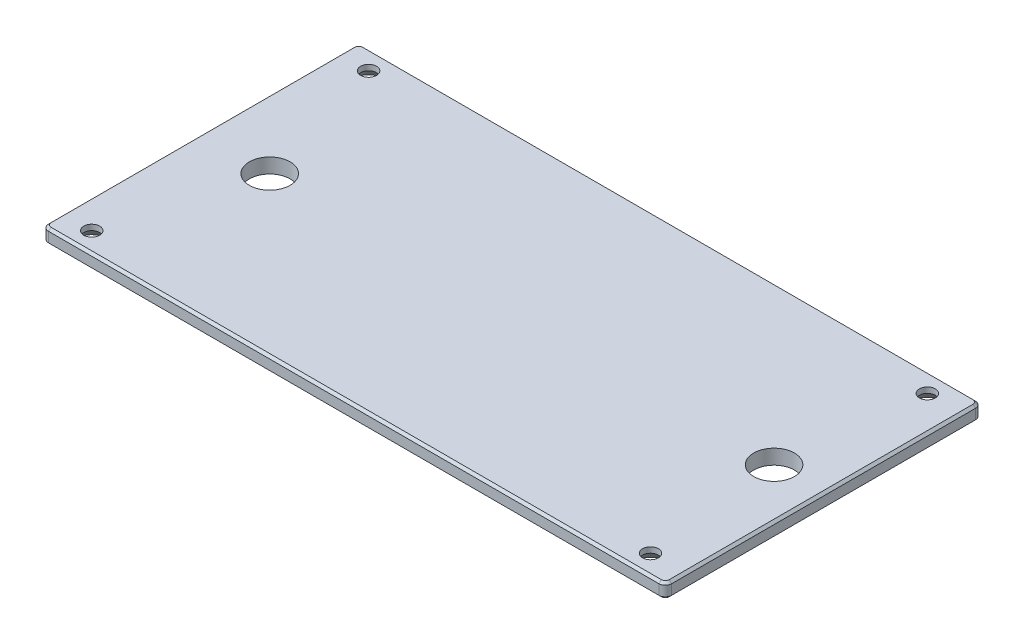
ISO-10303-21;
HEADER;
FILE_DESCRIPTION(('STEP AP214'),'2;1');
FILE_NAME('part.step','',(''),(''),'','','');
FILE_SCHEMA(('AUTOMOTIVE_DESIGN { 1 0 10303 214 1 1 1 1 }'));
ENDSEC;
DATA;
#1=APPLICATION_CONTEXT('core data for automotive mechanical design processes');
#2=APPLICATION_PROTOCOL_DEFINITION('international standard','automotive_design',2000,#1);
#3=PRODUCT_CONTEXT('',#1,'mechanical');
#4=PRODUCT('Part','Part','',(#3));
#5=PRODUCT_RELATED_PRODUCT_CATEGORY('part','',(#4));
#6=PRODUCT_DEFINITION_FORMATION('','',#4);
#7=PRODUCT_DEFINITION_CONTEXT('part definition',#1,'design');
#8=PRODUCT_DEFINITION('design','',#6,#7);
#9=PRODUCT_DEFINITION_SHAPE('','',#8);
#10=(LENGTH_UNIT() NAMED_UNIT(*) SI_UNIT(.MILLI.,.METRE.));
#11=(NAMED_UNIT(*) PLANE_ANGLE_UNIT() SI_UNIT($,.RADIAN.));
#12=(NAMED_UNIT(*) SI_UNIT($,.STERADIAN.) SOLID_ANGLE_UNIT());
#13=UNCERTAINTY_MEASURE_WITH_UNIT(LENGTH_MEASURE(1.E-05),#10,'distance_accuracy_value','');
#14=(GEOMETRIC_REPRESENTATION_CONTEXT(3) GLOBAL_UNCERTAINTY_ASSIGNED_CONTEXT((#13)) GLOBAL_UNIT_ASSIGNED_CONTEXT((#10,
#11,#12)) REPRESENTATION_CONTEXT('',''));
#15=CARTESIAN_POINT('',(0.,0.,0.));
#16=DIRECTION('',(0.,0.,1.));
#17=DIRECTION('',(1.,0.,0.));
#18=AXIS2_PLACEMENT_3D('',#15,#16,#17);
#19=CARTESIAN_POINT('',(-98.425,4.7498,-50.8));
#20=DIRECTION('',(1.,0.,0.));
#21=DIRECTION('',(0.,0.,-1.));
#22=AXIS2_PLACEMENT_3D('',#19,#20,#21);
#23=PLANE('',#22);
#24=DIRECTION('',(0.,-1.,0.));
#25=VECTOR('',#24,1.);
#26=CARTESIAN_POINT('',(-98.425,4.7498,48.768));
#27=LINE('',#26,#25);
#28=CARTESIAN_POINT('',(-98.425,0.761999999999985,48.768));
#29=VERTEX_POINT('',#28);
#30=CARTESIAN_POINT('',(-98.425,3.98780000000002,48.768));
#31=VERTEX_POINT('',#30);
#32=EDGE_CURVE('E302',#29,#31,#27,.F.);
#33=ORIENTED_EDGE('',*,*,#32,.T.);
#34=DIRECTION('',(0.,0.,-1.));
#35=VECTOR('',#34,1.);
#36=CARTESIAN_POINT('',(-98.425,3.9878000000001,-48.768));
#37=LINE('',#36,#35);
#38=CARTESIAN_POINT('',(-98.425,3.98780000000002,-48.768));
#39=VERTEX_POINT('',#38);
#40=EDGE_CURVE('E205',#31,#39,#37,.T.);
#41=ORIENTED_EDGE('',*,*,#40,.T.);
#42=DIRECTION('',(0.,-1.,0.));
#43=VECTOR('',#42,1.);
#44=CARTESIAN_POINT('',(-98.425,4.7498,-48.768));
#45=LINE('',#44,#43);
#46=CARTESIAN_POINT('',(-98.425,0.761999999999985,-48.768));
#47=VERTEX_POINT('',#46);
#48=EDGE_CURVE('E319',#39,#47,#45,.T.);
#49=ORIENTED_EDGE('',*,*,#48,.T.);
#50=DIRECTION('',(0.,0.,1.));
#51=VECTOR('',#50,1.);
#52=CARTESIAN_POINT('',(-98.425,0.761999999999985,-50.8));
#53=LINE('',#52,#51);
#54=EDGE_CURVE('E203',#47,#29,#53,.T.);
#55=ORIENTED_EDGE('',*,*,#54,.T.);
#56=EDGE_LOOP('',(#33,#41,#49,#55));
#57=FACE_BOUND('',#56,.T.);
#58=ADVANCED_FACE('F34',(#57),#23,.F.);
#59=CARTESIAN_POINT('',(-98.425,4.7498,50.8));
#60=DIRECTION('',(0.,0.,-1.));
#61=DIRECTION('',(-1.,0.,0.));
#62=AXIS2_PLACEMENT_3D('',#59,#60,#61);
#63=PLANE('',#62);
#64=DIRECTION('',(0.,-1.,0.));
#65=VECTOR('',#64,1.);
#66=CARTESIAN_POINT('',(99.568,4.7498,50.8));
#67=LINE('',#66,#65);
#68=CARTESIAN_POINT('',(99.568,0.761999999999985,50.8));
#69=VERTEX_POINT('',#68);
#70=CARTESIAN_POINT('',(99.568,3.98780000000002,50.8));
#71=VERTEX_POINT('',#70);
#72=EDGE_CURVE('E176',#69,#71,#67,.F.);
#73=ORIENTED_EDGE('',*,*,#72,.T.);
#74=DIRECTION('',(-1.,0.,0.));
#75=VECTOR('',#74,1.);
#76=CARTESIAN_POINT('',(-96.393,3.98780000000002,50.8));
#77=LINE('',#76,#75);
#78=CARTESIAN_POINT('',(-96.393,3.98780000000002,50.8));
#79=VERTEX_POINT('',#78);
#80=EDGE_CURVE('E225',#71,#79,#77,.T.);
#81=ORIENTED_EDGE('',*,*,#80,.T.);
#82=DIRECTION('',(0.,-1.,0.));
#83=VECTOR('',#82,1.);
#84=CARTESIAN_POINT('',(-96.393,4.7498,50.8));
#85=LINE('',#84,#83);
#86=CARTESIAN_POINT('',(-96.393,0.761999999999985,50.8));
#87=VERTEX_POINT('',#86);
#88=EDGE_CURVE('E180',#79,#87,#85,.T.);
#89=ORIENTED_EDGE('',*,*,#88,.T.);
#90=DIRECTION('',(1.,0.,0.));
#91=VECTOR('',#90,1.);
#92=CARTESIAN_POINT('',(-98.425,0.761999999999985,50.8));
#93=LINE('',#92,#91);
#94=EDGE_CURVE('E222',#87,#69,#93,.T.);
#95=ORIENTED_EDGE('',*,*,#94,.T.);
#96=EDGE_LOOP('',(#73,#81,#89,#95));
#97=FACE_BOUND('',#96,.T.);
#98=ADVANCED_FACE('F304',(#97),#63,.F.);
#99=CARTESIAN_POINT('',(101.6,4.7498,-50.8));
#100=DIRECTION('',(-1.,0.,0.));
#101=DIRECTION('',(0.,0.,1.));
#102=AXIS2_PLACEMENT_3D('',#99,#100,#101);
#103=PLANE('',#102);
#104=DIRECTION('',(0.,-1.,0.));
#105=VECTOR('',#104,1.);
#106=CARTESIAN_POINT('',(101.6,4.7498,-48.768));
#107=LINE('',#106,#105);
#108=CARTESIAN_POINT('',(101.6,0.761999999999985,-48.768));
#109=VERTEX_POINT('',#108);
#110=CARTESIAN_POINT('',(101.6,3.98780000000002,-48.768));
#111=VERTEX_POINT('',#110);
#112=EDGE_CURVE('E306',#109,#111,#107,.F.);
#113=ORIENTED_EDGE('',*,*,#112,.T.);
#114=DIRECTION('',(0.,0.,1.));
#115=VECTOR('',#114,1.);
#116=CARTESIAN_POINT('',(101.6,3.98780000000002,48.768));
#117=LINE('',#116,#115);
#118=CARTESIAN_POINT('',(101.6,3.98780000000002,48.768));
#119=VERTEX_POINT('',#118);
#120=EDGE_CURVE('E196',#111,#119,#117,.T.);
#121=ORIENTED_EDGE('',*,*,#120,.T.);
#122=DIRECTION('',(0.,-1.,0.));
#123=VECTOR('',#122,1.);
#124=CARTESIAN_POINT('',(101.6,4.7498,48.768));
#125=LINE('',#124,#123);
#126=CARTESIAN_POINT('',(101.6,0.761999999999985,48.768));
#127=VERTEX_POINT('',#126);
#128=EDGE_CURVE('E308',#119,#127,#125,.T.);
#129=ORIENTED_EDGE('',*,*,#128,.T.);
#130=DIRECTION('',(0.,0.,-1.));
#131=VECTOR('',#130,1.);
#132=CARTESIAN_POINT('',(101.6,0.761999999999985,-50.8));
#133=LINE('',#132,#131);
#134=EDGE_CURVE('E194',#127,#109,#133,.T.);
#135=ORIENTED_EDGE('',*,*,#134,.T.);
#136=EDGE_LOOP('',(#113,#121,#129,#135));
#137=FACE_BOUND('',#136,.T.);
#138=ADVANCED_FACE('F407',(#137),#103,.F.);
#139=CARTESIAN_POINT('',(-98.425,4.7498,-50.8));
#140=DIRECTION('',(0.,0.,1.));
#141=DIRECTION('',(1.,0.,0.));
#142=AXIS2_PLACEMENT_3D('',#139,#140,#141);
#143=PLANE('',#142);
#144=DIRECTION('',(0.,-1.,0.));
#145=VECTOR('',#144,1.);
#146=CARTESIAN_POINT('',(-96.393,4.7498,-50.8));
#147=LINE('',#146,#145);
#148=CARTESIAN_POINT('',(-96.393,0.761999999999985,-50.8));
#149=VERTEX_POINT('',#148);
#150=CARTESIAN_POINT('',(-96.393,3.98780000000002,-50.8));
#151=VERTEX_POINT('',#150);
#152=EDGE_CURVE('E313',#149,#151,#147,.F.);
#153=ORIENTED_EDGE('',*,*,#152,.T.);
#154=DIRECTION('',(1.,0.,0.));
#155=VECTOR('',#154,1.);
#156=CARTESIAN_POINT('',(99.5679999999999,3.98780000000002,-50.8));
#157=LINE('',#156,#155);
#158=CARTESIAN_POINT('',(99.568,3.98780000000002,-50.8));
#159=VERTEX_POINT('',#158);
#160=EDGE_CURVE('E201',#151,#159,#157,.T.);
#161=ORIENTED_EDGE('',*,*,#160,.T.);
#162=DIRECTION('',(0.,-1.,0.));
#163=VECTOR('',#162,1.);
#164=CARTESIAN_POINT('',(99.568,4.7498,-50.8));
#165=LINE('',#164,#163);
#166=CARTESIAN_POINT('',(99.568,0.761999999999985,-50.8));
#167=VERTEX_POINT('',#166);
#168=EDGE_CURVE('E316',#159,#167,#165,.T.);
#169=ORIENTED_EDGE('',*,*,#168,.T.);
#170=DIRECTION('',(-1.,0.,0.));
#171=VECTOR('',#170,1.);
#172=CARTESIAN_POINT('',(-98.425,0.761999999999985,-50.8));
#173=LINE('',#172,#171);
#174=EDGE_CURVE('E199',#167,#149,#173,.T.);
#175=ORIENTED_EDGE('',*,*,#174,.T.);
#176=EDGE_LOOP('',(#153,#161,#169,#175));
#177=FACE_BOUND('',#176,.T.);
#178=ADVANCED_FACE('F604',(#177),#143,.F.);
#179=CARTESIAN_POINT('',(0.,4.7498,0.));
#180=DIRECTION('',(0.,1.,0.));
#181=DIRECTION('',(0.,0.,1.));
#182=AXIS2_PLACEMENT_3D('',#179,#180,#181);
#183=PLANE('',#182);
#184=CARTESIAN_POINT('',(99.568,4.7498,-48.768));
#185=DIRECTION('',(0.,1.,0.));
#186=DIRECTION('',(0.,0.,1.));
#187=AXIS2_PLACEMENT_3D('',#184,#185,#186);
#188=CIRCLE('',#187,1.27000000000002);
#189=CARTESIAN_POINT('',(100.838,4.7498,-48.768));
#190=VERTEX_POINT('',#189);
#191=CARTESIAN_POINT('',(99.568,4.7498,-50.038));
#192=VERTEX_POINT('',#191);
#193=EDGE_CURVE('E188',#190,#192,#188,.T.);
#194=ORIENTED_EDGE('',*,*,#193,.T.);
#195=DIRECTION('',(-1.,0.,0.));
#196=VECTOR('',#195,1.);
#197=CARTESIAN_POINT('',(-96.393,4.7498,-50.038));
#198=LINE('',#197,#196);
#199=CARTESIAN_POINT('',(-96.393,4.7498,-50.038));
#200=VERTEX_POINT('',#199);
#201=EDGE_CURVE('E192',#192,#200,#198,.T.);
#202=ORIENTED_EDGE('',*,*,#201,.T.);
#203=CARTESIAN_POINT('',(-96.393,4.7498,-48.768));
#204=DIRECTION('',(0.,1.,0.));
#205=DIRECTION('',(0.,0.,1.));
#206=AXIS2_PLACEMENT_3D('',#203,#204,#205);
#207=CIRCLE('',#206,1.27000000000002);
#208=CARTESIAN_POINT('',(-97.6630000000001,4.7498,-48.768));
#209=VERTEX_POINT('',#208);
#210=EDGE_CURVE('E190',#200,#209,#207,.T.);
#211=ORIENTED_EDGE('',*,*,#210,.T.);
#212=DIRECTION('',(0.,0.,1.));
#213=VECTOR('',#212,1.);
#214=CARTESIAN_POINT('',(-97.6630000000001,4.7498,48.768));
#215=LINE('',#214,#213);
#216=CARTESIAN_POINT('',(-97.663,4.7498,48.768));
#217=VERTEX_POINT('',#216);
#218=EDGE_CURVE('E156',#209,#217,#215,.T.);
#219=ORIENTED_EDGE('',*,*,#218,.T.);
#220=CARTESIAN_POINT('',(-96.393,4.7498,48.768));
#221=DIRECTION('',(0.,1.,0.));
#222=DIRECTION('',(0.,0.,1.));
#223=AXIS2_PLACEMENT_3D('',#220,#221,#222);
#224=CIRCLE('',#223,1.27000000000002);
#225=CARTESIAN_POINT('',(-96.393,4.7498,50.038));
#226=VERTEX_POINT('',#225);
#227=EDGE_CURVE('E148',#217,#226,#224,.T.);
#228=ORIENTED_EDGE('',*,*,#227,.T.);
#229=DIRECTION('',(1.,0.,0.));
#230=VECTOR('',#229,1.);
#231=CARTESIAN_POINT('',(99.568,4.7498,50.038));
#232=LINE('',#231,#230);
#233=CARTESIAN_POINT('',(99.568,4.7498,50.038));
#234=VERTEX_POINT('',#233);
#235=EDGE_CURVE('E153',#226,#234,#232,.T.);
#236=ORIENTED_EDGE('',*,*,#235,.T.);
#237=CARTESIAN_POINT('',(99.568,4.7498,48.768));
#238=DIRECTION('',(0.,1.,0.));
#239=DIRECTION('',(0.,0.,1.));
#240=AXIS2_PLACEMENT_3D('',#237,#238,#239);
#241=CIRCLE('',#240,1.27000000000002);
#242=CARTESIAN_POINT('',(100.838,4.7498,48.768));
#243=VERTEX_POINT('',#242);
#244=EDGE_CURVE('E160',#234,#243,#241,.T.);
#245=ORIENTED_EDGE('',*,*,#244,.T.);
#246=DIRECTION('',(0.,0.,-1.));
#247=VECTOR('',#246,1.);
#248=CARTESIAN_POINT('',(100.838,4.7498,-48.768));
#249=LINE('',#248,#247);
#250=EDGE_CURVE('E185',#243,#190,#249,.T.);
#251=ORIENTED_EDGE('',*,*,#250,.T.);
#252=EDGE_LOOP('',(#194,#202,#211,#219,#228,#236,#245,#251));
#253=FACE_BOUND('',#252,.T.);
#254=CARTESIAN_POINT('',(-76.2,4.7498,0.));
#255=DIRECTION('',(0.,-1.,0.));
#256=DIRECTION('',(0.,0.,-1.));
#257=AXIS2_PLACEMENT_3D('',#254,#255,#256);
#258=CIRCLE('',#257,6.54050000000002);
#259=CARTESIAN_POINT('',(-76.2,4.7498,-6.54050000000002));
#260=VERTEX_POINT('',#259);
#261=EDGE_CURVE('E365',#260,#260,#258,.T.);
#262=ORIENTED_EDGE('',*,*,#261,.T.);
#263=EDGE_LOOP('',(#262));
#264=FACE_BOUND('',#263,.T.);
#265=CARTESIAN_POINT('',(85.725,4.7498,0.));
#266=DIRECTION('',(0.,-1.,0.));
#267=DIRECTION('',(0.,0.,-1.));
#268=AXIS2_PLACEMENT_3D('',#265,#266,#267);
#269=CIRCLE('',#268,6.54050000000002);
#270=CARTESIAN_POINT('',(85.725,4.7498,-6.54050000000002));
#271=VERTEX_POINT('',#270);
#272=EDGE_CURVE('E359',#271,#271,#269,.T.);
#273=ORIENTED_EDGE('',*,*,#272,.T.);
#274=EDGE_LOOP('',(#273));
#275=FACE_BOUND('',#274,.T.);
#276=CARTESIAN_POINT('',(-88.9,4.7498,44.45));
#277=DIRECTION('',(0.,1.,0.));
#278=DIRECTION('',(0.,0.,1.));
#279=AXIS2_PLACEMENT_3D('',#276,#277,#278);
#280=CIRCLE('',#279,2.5527);
#281=CARTESIAN_POINT('',(-88.9,4.7498,47.0027));
#282=VERTEX_POINT('',#281);
#283=EDGE_CURVE('E324',#282,#282,#280,.T.);
#284=ORIENTED_EDGE('',*,*,#283,.F.);
#285=EDGE_LOOP('',(#284));
#286=FACE_BOUND('',#285,.T.);
#287=CARTESIAN_POINT('',(90.5002,4.7498,44.45));
#288=DIRECTION('',(0.,1.,0.));
#289=DIRECTION('',(0.,0.,1.));
#290=AXIS2_PLACEMENT_3D('',#287,#288,#289);
#291=CIRCLE('',#290,2.5527);
#292=CARTESIAN_POINT('',(90.5002,4.7498,47.0027));
#293=VERTEX_POINT('',#292);
#294=EDGE_CURVE('E329',#293,#293,#291,.T.);
#295=ORIENTED_EDGE('',*,*,#294,.F.);
#296=EDGE_LOOP('',(#295));
#297=FACE_BOUND('',#296,.T.);
#298=CARTESIAN_POINT('',(90.5002,4.7498,-44.45));
#299=DIRECTION('',(0.,1.,0.));
#300=DIRECTION('',(0.,0.,1.));
#301=AXIS2_PLACEMENT_3D('',#298,#299,#300);
#302=CIRCLE('',#301,2.5527);
#303=CARTESIAN_POINT('',(90.5002,4.7498,-41.8973));
#304=VERTEX_POINT('',#303);
#305=EDGE_CURVE('E334',#304,#304,#302,.T.);
#306=ORIENTED_EDGE('',*,*,#305,.F.);
#307=EDGE_LOOP('',(#306));
#308=FACE_BOUND('',#307,.T.);
#309=CARTESIAN_POINT('',(-88.9,4.7498,-44.45));
#310=DIRECTION('',(0.,1.,0.));
#311=DIRECTION('',(0.,0.,1.));
#312=AXIS2_PLACEMENT_3D('',#309,#310,#311);
#313=CIRCLE('',#312,2.5527);
#314=CARTESIAN_POINT('',(-88.9,4.7498,-41.8973));
#315=VERTEX_POINT('',#314);
#316=EDGE_CURVE('E323',#315,#315,#313,.T.);
#317=ORIENTED_EDGE('',*,*,#316,.F.);
#318=EDGE_LOOP('',(#317));
#319=FACE_BOUND('',#318,.T.);
#320=ADVANCED_FACE('F150',(#253,#264,#275,#286,#297,#308,#319),#183,.T.);
#321=CARTESIAN_POINT('',(0.,0.,0.));
#322=DIRECTION('',(0.,1.,0.));
#323=DIRECTION('',(0.,0.,1.));
#324=AXIS2_PLACEMENT_3D('',#321,#322,#323);
#325=PLANE('',#324);
#326=CARTESIAN_POINT('',(99.568,0.,48.768));
#327=DIRECTION('',(0.,1.,0.));
#328=DIRECTION('',(0.,0.,1.));
#329=AXIS2_PLACEMENT_3D('',#326,#327,#328);
#330=CIRCLE('',#329,1.26999999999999);
#331=CARTESIAN_POINT('',(100.838,0.,48.768));
#332=VERTEX_POINT('',#331);
#333=CARTESIAN_POINT('',(99.568,0.,50.038));
#334=VERTEX_POINT('',#333);
#335=EDGE_CURVE('E43',#332,#334,#330,.F.);
#336=ORIENTED_EDGE('',*,*,#335,.T.);
#337=DIRECTION('',(-1.,0.,0.));
#338=VECTOR('',#337,1.);
#339=CARTESIAN_POINT('',(0.,0.,50.038));
#340=LINE('',#339,#338);
#341=CARTESIAN_POINT('',(-96.393,0.,50.038));
#342=VERTEX_POINT('',#341);
#343=EDGE_CURVE('E11',#334,#342,#340,.T.);
#344=ORIENTED_EDGE('',*,*,#343,.T.);
#345=CARTESIAN_POINT('',(-96.393,0.,48.768));
#346=DIRECTION('',(0.,1.,0.));
#347=DIRECTION('',(0.,0.,1.));
#348=AXIS2_PLACEMENT_3D('',#345,#346,#347);
#349=CIRCLE('',#348,1.26999999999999);
#350=CARTESIAN_POINT('',(-97.663,0.,48.768));
#351=VERTEX_POINT('',#350);
#352=EDGE_CURVE('E237',#342,#351,#349,.F.);
#353=ORIENTED_EDGE('',*,*,#352,.T.);
#354=DIRECTION('',(0.,0.,-1.));
#355=VECTOR('',#354,1.);
#356=CARTESIAN_POINT('',(-97.663,0.,0.));
#357=LINE('',#356,#355);
#358=CARTESIAN_POINT('',(-97.663,0.,-48.768));
#359=VERTEX_POINT('',#358);
#360=EDGE_CURVE('E233',#351,#359,#357,.T.);
#361=ORIENTED_EDGE('',*,*,#360,.T.);
#362=CARTESIAN_POINT('',(-96.393,0.,-48.768));
#363=DIRECTION('',(0.,1.,0.));
#364=DIRECTION('',(0.,0.,1.));
#365=AXIS2_PLACEMENT_3D('',#362,#363,#364);
#366=CIRCLE('',#365,1.26999999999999);
#367=CARTESIAN_POINT('',(-96.393,0.,-50.038));
#368=VERTEX_POINT('',#367);
#369=EDGE_CURVE('E229',#359,#368,#366,.F.);
#370=ORIENTED_EDGE('',*,*,#369,.T.);
#371=DIRECTION('',(1.,0.,0.));
#372=VECTOR('',#371,1.);
#373=CARTESIAN_POINT('',(0.,0.,-50.038));
#374=LINE('',#373,#372);
#375=CARTESIAN_POINT('',(99.568,0.,-50.038));
#376=VERTEX_POINT('',#375);
#377=EDGE_CURVE('E227',#368,#376,#374,.T.);
#378=ORIENTED_EDGE('',*,*,#377,.T.);
#379=CARTESIAN_POINT('',(99.568,0.,-48.768));
#380=DIRECTION('',(0.,1.,0.));
#381=DIRECTION('',(0.,0.,1.));
#382=AXIS2_PLACEMENT_3D('',#379,#380,#381);
#383=CIRCLE('',#382,1.26999999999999);
#384=CARTESIAN_POINT('',(100.838,0.,-48.768));
#385=VERTEX_POINT('',#384);
#386=EDGE_CURVE('E231',#376,#385,#383,.F.);
#387=ORIENTED_EDGE('',*,*,#386,.T.);
#388=DIRECTION('',(0.,0.,1.));
#389=VECTOR('',#388,1.);
#390=CARTESIAN_POINT('',(100.838,0.,0.));
#391=LINE('',#390,#389);
#392=EDGE_CURVE('E235',#385,#332,#391,.T.);
#393=ORIENTED_EDGE('',*,*,#392,.T.);
#394=EDGE_LOOP('',(#336,#344,#353,#361,#370,#378,#387,#393));
#395=FACE_BOUND('',#394,.T.);
#396=CARTESIAN_POINT('',(-76.2,0.,0.));
#397=DIRECTION('',(0.,-1.,0.));
#398=DIRECTION('',(0.,0.,-1.));
#399=AXIS2_PLACEMENT_3D('',#396,#397,#398);
#400=CIRCLE('',#399,6.54050000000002);
#401=CARTESIAN_POINT('',(-76.2,0.,-6.54050000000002));
#402=VERTEX_POINT('',#401);
#403=EDGE_CURVE('E254',#402,#402,#400,.T.);
#404=ORIENTED_EDGE('',*,*,#403,.F.);
#405=EDGE_LOOP('',(#404));
#406=FACE_BOUND('',#405,.T.);
#407=CARTESIAN_POINT('',(85.725,0.,0.));
#408=DIRECTION('',(0.,-1.,0.));
#409=DIRECTION('',(0.,0.,-1.));
#410=AXIS2_PLACEMENT_3D('',#407,#408,#409);
#411=CIRCLE('',#410,6.54050000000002);
#412=CARTESIAN_POINT('',(85.725,0.,-6.54050000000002));
#413=VERTEX_POINT('',#412);
#414=EDGE_CURVE('E362',#413,#413,#411,.T.);
#415=ORIENTED_EDGE('',*,*,#414,.F.);
#416=EDGE_LOOP('',(#415));
#417=FACE_BOUND('',#416,.T.);
#418=CARTESIAN_POINT('',(-88.9,0.,44.45));
#419=DIRECTION('',(0.,-1.,0.));
#420=DIRECTION('',(0.,0.,-1.));
#421=AXIS2_PLACEMENT_3D('',#418,#419,#420);
#422=CIRCLE('',#421,5.1287553);
#423=CARTESIAN_POINT('',(-88.9,0.,39.3212447));
#424=VERTEX_POINT('',#423);
#425=EDGE_CURVE('E356',#424,#424,#422,.T.);
#426=ORIENTED_EDGE('',*,*,#425,.F.);
#427=EDGE_LOOP('',(#426));
#428=FACE_BOUND('',#427,.T.);
#429=CARTESIAN_POINT('',(90.5002,0.,44.45));
#430=DIRECTION('',(0.,-1.,0.));
#431=DIRECTION('',(0.,0.,-1.));
#432=AXIS2_PLACEMENT_3D('',#429,#430,#431);
#433=CIRCLE('',#432,5.1287553);
#434=CARTESIAN_POINT('',(90.5002,0.,39.3212447));
#435=VERTEX_POINT('',#434);
#436=EDGE_CURVE('E327',#435,#435,#433,.T.);
#437=ORIENTED_EDGE('',*,*,#436,.F.);
#438=EDGE_LOOP('',(#437));
#439=FACE_BOUND('',#438,.T.);
#440=CARTESIAN_POINT('',(90.5002,0.,-44.45));
#441=DIRECTION('',(0.,-1.,0.));
#442=DIRECTION('',(0.,0.,-1.));
#443=AXIS2_PLACEMENT_3D('',#440,#441,#442);
#444=CIRCLE('',#443,5.1287553);
#445=CARTESIAN_POINT('',(90.5002,0.,-49.5787553));
#446=VERTEX_POINT('',#445);
#447=EDGE_CURVE('E332',#446,#446,#444,.T.);
#448=ORIENTED_EDGE('',*,*,#447,.F.);
#449=EDGE_LOOP('',(#448));
#450=FACE_BOUND('',#449,.T.);
#451=CARTESIAN_POINT('',(-88.9,0.,-44.45));
#452=DIRECTION('',(0.,-1.,0.));
#453=DIRECTION('',(0.,0.,-1.));
#454=AXIS2_PLACEMENT_3D('',#451,#452,#453);
#455=CIRCLE('',#454,5.1287553);
#456=CARTESIAN_POINT('',(-88.9,0.,-49.5787553));
#457=VERTEX_POINT('',#456);
#458=EDGE_CURVE('E337',#457,#457,#455,.T.);
#459=ORIENTED_EDGE('',*,*,#458,.F.);
#460=EDGE_LOOP('',(#459));
#461=FACE_BOUND('',#460,.T.);
#462=ADVANCED_FACE('F285',(#395,#406,#417,#428,#439,#450,#461),#325,.F.);
#463=CARTESIAN_POINT('',(-88.9,0.,-44.45));
#464=DIRECTION('',(0.,-1.,0.));
#465=DIRECTION('',(0.,0.,-1.));
#466=AXIS2_PLACEMENT_3D('',#463,#464,#465);
#467=CYLINDRICAL_SURFACE('',#466,2.5527);
#468=ORIENTED_EDGE('',*,*,#316,.T.);
#469=EDGE_LOOP('',(#468));
#470=FACE_BOUND('',#469,.T.);
#471=CARTESIAN_POINT('',(-88.9,2.96341263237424,-44.45));
#472=DIRECTION('',(0.,-1.,0.));
#473=DIRECTION('',(0.,0.,-1.));
#474=AXIS2_PLACEMENT_3D('',#471,#472,#473);
#475=CIRCLE('',#474,2.55270000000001);
#476=CARTESIAN_POINT('',(-88.9,2.96341263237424,-47.0027));
#477=VERTEX_POINT('',#476);
#478=EDGE_CURVE('E341',#477,#477,#475,.T.);
#479=ORIENTED_EDGE('',*,*,#478,.T.);
#480=EDGE_LOOP('',(#479));
#481=FACE_BOUND('',#480,.T.);
#482=ADVANCED_FACE('F374',(#470,#481),#467,.F.);
#483=CARTESIAN_POINT('',(-88.9,0.,-44.45));
#484=DIRECTION('',(0.,-1.,0.));
#485=DIRECTION('',(0.,0.,-1.));
#486=AXIS2_PLACEMENT_3D('',#483,#484,#485);
#487=CONICAL_SURFACE('',#486,5.1287553,0.715584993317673);
#488=ORIENTED_EDGE('',*,*,#478,.F.);
#489=EDGE_LOOP('',(#488));
#490=FACE_BOUND('',#489,.T.);
#491=ORIENTED_EDGE('',*,*,#458,.T.);
#492=EDGE_LOOP('',(#491));
#493=FACE_BOUND('',#492,.T.);
#494=ADVANCED_FACE('F386',(#490,#493),#487,.F.);
#495=CARTESIAN_POINT('',(90.5002,0.,-44.45));
#496=DIRECTION('',(0.,-1.,0.));
#497=DIRECTION('',(0.,0.,-1.));
#498=AXIS2_PLACEMENT_3D('',#495,#496,#497);
#499=CYLINDRICAL_SURFACE('',#498,2.5527);
#500=ORIENTED_EDGE('',*,*,#305,.T.);
#501=EDGE_LOOP('',(#500));
#502=FACE_BOUND('',#501,.T.);
#503=CARTESIAN_POINT('',(90.5002,2.96341263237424,-44.45));
#504=DIRECTION('',(0.,-1.,0.));
#505=DIRECTION('',(0.,0.,-1.));
#506=AXIS2_PLACEMENT_3D('',#503,#504,#505);
#507=CIRCLE('',#506,2.55270000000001);
#508=CARTESIAN_POINT('',(90.5002,2.96341263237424,-47.0027));
#509=VERTEX_POINT('',#508);
#510=EDGE_CURVE('E338',#509,#509,#507,.T.);
#511=ORIENTED_EDGE('',*,*,#510,.T.);
#512=EDGE_LOOP('',(#511));
#513=FACE_BOUND('',#512,.T.);
#514=ADVANCED_FACE('F388',(#502,#513),#499,.F.);
#515=CARTESIAN_POINT('',(90.5002,0.,-44.45));
#516=DIRECTION('',(0.,-1.,0.));
#517=DIRECTION('',(0.,0.,-1.));
#518=AXIS2_PLACEMENT_3D('',#515,#516,#517);
#519=CONICAL_SURFACE('',#518,5.1287553,0.715584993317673);
#520=ORIENTED_EDGE('',*,*,#510,.F.);
#521=EDGE_LOOP('',(#520));
#522=FACE_BOUND('',#521,.T.);
#523=ORIENTED_EDGE('',*,*,#447,.T.);
#524=EDGE_LOOP('',(#523));
#525=FACE_BOUND('',#524,.T.);
#526=ADVANCED_FACE('F395',(#522,#525),#519,.F.);
#527=CARTESIAN_POINT('',(90.5002,0.,44.45));
#528=DIRECTION('',(0.,-1.,0.));
#529=DIRECTION('',(0.,0.,-1.));
#530=AXIS2_PLACEMENT_3D('',#527,#528,#529);
#531=CYLINDRICAL_SURFACE('',#530,2.5527);
#532=ORIENTED_EDGE('',*,*,#294,.T.);
#533=EDGE_LOOP('',(#532));
#534=FACE_BOUND('',#533,.T.);
#535=CARTESIAN_POINT('',(90.5002,2.96341263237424,44.45));
#536=DIRECTION('',(0.,-1.,0.));
#537=DIRECTION('',(0.,0.,-1.));
#538=AXIS2_PLACEMENT_3D('',#535,#536,#537);
#539=CIRCLE('',#538,2.55270000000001);
#540=CARTESIAN_POINT('',(90.5002,2.96341263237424,41.8973));
#541=VERTEX_POINT('',#540);
#542=EDGE_CURVE('E333',#541,#541,#539,.T.);
#543=ORIENTED_EDGE('',*,*,#542,.T.);
#544=EDGE_LOOP('',(#543));
#545=FACE_BOUND('',#544,.T.);
#546=ADVANCED_FACE('F563',(#534,#545),#531,.F.);
#547=CARTESIAN_POINT('',(90.5002,0.,44.45));
#548=DIRECTION('',(0.,-1.,0.));
#549=DIRECTION('',(0.,0.,-1.));
#550=AXIS2_PLACEMENT_3D('',#547,#548,#549);
#551=CONICAL_SURFACE('',#550,5.1287553,0.715584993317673);
#552=ORIENTED_EDGE('',*,*,#542,.F.);
#553=EDGE_LOOP('',(#552));
#554=FACE_BOUND('',#553,.T.);
#555=ORIENTED_EDGE('',*,*,#436,.T.);
#556=EDGE_LOOP('',(#555));
#557=FACE_BOUND('',#556,.T.);
#558=ADVANCED_FACE('F555',(#554,#557),#551,.F.);
#559=CARTESIAN_POINT('',(-88.9,0.,44.45));
#560=DIRECTION('',(0.,-1.,0.));
#561=DIRECTION('',(0.,0.,-1.));
#562=AXIS2_PLACEMENT_3D('',#559,#560,#561);
#563=CYLINDRICAL_SURFACE('',#562,2.5527);
#564=ORIENTED_EDGE('',*,*,#283,.T.);
#565=EDGE_LOOP('',(#564));
#566=FACE_BOUND('',#565,.T.);
#567=CARTESIAN_POINT('',(-88.9,2.96341263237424,44.45));
#568=DIRECTION('',(0.,-1.,0.));
#569=DIRECTION('',(0.,0.,-1.));
#570=AXIS2_PLACEMENT_3D('',#567,#568,#569);
#571=CIRCLE('',#570,2.55270000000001);
#572=CARTESIAN_POINT('',(-88.9,2.96341263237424,41.8973));
#573=VERTEX_POINT('',#572);
#574=EDGE_CURVE('E328',#573,#573,#571,.T.);
#575=ORIENTED_EDGE('',*,*,#574,.T.);
#576=EDGE_LOOP('',(#575));
#577=FACE_BOUND('',#576,.T.);
#578=ADVANCED_FACE('F547',(#566,#577),#563,.F.);
#579=CARTESIAN_POINT('',(-88.9,0.,44.45));
#580=DIRECTION('',(0.,-1.,0.));
#581=DIRECTION('',(0.,0.,-1.));
#582=AXIS2_PLACEMENT_3D('',#579,#580,#581);
#583=CONICAL_SURFACE('',#582,5.1287553,0.715584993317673);
#584=ORIENTED_EDGE('',*,*,#574,.F.);
#585=EDGE_LOOP('',(#584));
#586=FACE_BOUND('',#585,.T.);
#587=ORIENTED_EDGE('',*,*,#425,.T.);
#588=EDGE_LOOP('',(#587));
#589=FACE_BOUND('',#588,.T.);
#590=ADVANCED_FACE('F539',(#586,#589),#583,.F.);
#591=CARTESIAN_POINT('',(85.725,0.,0.));
#592=DIRECTION('',(0.,-1.,0.));
#593=DIRECTION('',(0.,0.,-1.));
#594=AXIS2_PLACEMENT_3D('',#591,#592,#593);
#595=CYLINDRICAL_SURFACE('',#594,6.54050000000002);
#596=ORIENTED_EDGE('',*,*,#272,.F.);
#597=EDGE_LOOP('',(#596));
#598=FACE_BOUND('',#597,.T.);
#599=ORIENTED_EDGE('',*,*,#414,.T.);
#600=EDGE_LOOP('',(#599));
#601=FACE_BOUND('',#600,.T.);
#602=ADVANCED_FACE('F531',(#598,#601),#595,.F.);
#603=CARTESIAN_POINT('',(-76.2,0.,0.));
#604=DIRECTION('',(0.,-1.,0.));
#605=DIRECTION('',(0.,0.,-1.));
#606=AXIS2_PLACEMENT_3D('',#603,#604,#605);
#607=CYLINDRICAL_SURFACE('',#606,6.54050000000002);
#608=ORIENTED_EDGE('',*,*,#261,.F.);
#609=EDGE_LOOP('',(#608));
#610=FACE_BOUND('',#609,.T.);
#611=ORIENTED_EDGE('',*,*,#403,.T.);
#612=EDGE_LOOP('',(#611));
#613=FACE_BOUND('',#612,.T.);
#614=ADVANCED_FACE('F371',(#610,#613),#607,.F.);
#615=CARTESIAN_POINT('',(-96.393,4.7498,-48.768));
#616=DIRECTION('',(0.,-1.,0.));
#617=DIRECTION('',(0.,0.,-1.));
#618=AXIS2_PLACEMENT_3D('',#615,#616,#617);
#619=CYLINDRICAL_SURFACE('',#618,2.032);
#620=ORIENTED_EDGE('',*,*,#48,.F.);
#621=CARTESIAN_POINT('',(-96.393,3.98780000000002,-48.768));
#622=DIRECTION('',(0.,1.,0.));
#623=DIRECTION('',(0.,0.,1.));
#624=AXIS2_PLACEMENT_3D('',#621,#622,#623);
#625=CIRCLE('',#624,2.032);
#626=EDGE_CURVE('E209',#39,#151,#625,.F.);
#627=ORIENTED_EDGE('',*,*,#626,.T.);
#628=ORIENTED_EDGE('',*,*,#152,.F.);
#629=CARTESIAN_POINT('',(-96.393,0.761999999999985,-48.768));
#630=DIRECTION('',(0.,1.,0.));
#631=DIRECTION('',(0.,0.,1.));
#632=AXIS2_PLACEMENT_3D('',#629,#630,#631);
#633=CIRCLE('',#632,2.032);
#634=EDGE_CURVE('E207',#149,#47,#633,.T.);
#635=ORIENTED_EDGE('',*,*,#634,.T.);
#636=EDGE_LOOP('',(#620,#627,#628,#635));
#637=FACE_BOUND('',#636,.T.);
#638=ADVANCED_FACE('F411',(#637),#619,.T.);
#639=CARTESIAN_POINT('',(99.568,4.7498,-48.768));
#640=DIRECTION('',(0.,-1.,0.));
#641=DIRECTION('',(0.,0.,-1.));
#642=AXIS2_PLACEMENT_3D('',#639,#640,#641);
#643=CYLINDRICAL_SURFACE('',#642,2.032);
#644=ORIENTED_EDGE('',*,*,#168,.F.);
#645=CARTESIAN_POINT('',(99.568,3.98780000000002,-48.768));
#646=DIRECTION('',(0.,1.,0.));
#647=DIRECTION('',(0.,0.,1.));
#648=AXIS2_PLACEMENT_3D('',#645,#646,#647);
#649=CIRCLE('',#648,2.032);
#650=EDGE_CURVE('E213',#159,#111,#649,.F.);
#651=ORIENTED_EDGE('',*,*,#650,.T.);
#652=ORIENTED_EDGE('',*,*,#112,.F.);
#653=CARTESIAN_POINT('',(99.568,0.761999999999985,-48.768));
#654=DIRECTION('',(0.,1.,0.));
#655=DIRECTION('',(0.,0.,1.));
#656=AXIS2_PLACEMENT_3D('',#653,#654,#655);
#657=CIRCLE('',#656,2.032);
#658=EDGE_CURVE('E211',#109,#167,#657,.T.);
#659=ORIENTED_EDGE('',*,*,#658,.T.);
#660=EDGE_LOOP('',(#644,#651,#652,#659));
#661=FACE_BOUND('',#660,.T.);
#662=ADVANCED_FACE('F414',(#661),#643,.T.);
#663=CARTESIAN_POINT('',(99.568,4.7498,48.768));
#664=DIRECTION('',(0.,-1.,0.));
#665=DIRECTION('',(0.,0.,-1.));
#666=AXIS2_PLACEMENT_3D('',#663,#664,#665);
#667=CYLINDRICAL_SURFACE('',#666,2.032);
#668=ORIENTED_EDGE('',*,*,#128,.F.);
#669=CARTESIAN_POINT('',(99.568,3.98780000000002,48.768));
#670=DIRECTION('',(0.,1.,0.));
#671=DIRECTION('',(0.,0.,1.));
#672=AXIS2_PLACEMENT_3D('',#669,#670,#671);
#673=CIRCLE('',#672,2.032);
#674=EDGE_CURVE('E220',#119,#71,#673,.F.);
#675=ORIENTED_EDGE('',*,*,#674,.T.);
#676=ORIENTED_EDGE('',*,*,#72,.F.);
#677=CARTESIAN_POINT('',(99.568,0.761999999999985,48.768));
#678=DIRECTION('',(0.,1.,0.));
#679=DIRECTION('',(0.,0.,1.));
#680=AXIS2_PLACEMENT_3D('',#677,#678,#679);
#681=CIRCLE('',#680,2.032);
#682=EDGE_CURVE('E218',#69,#127,#681,.T.);
#683=ORIENTED_EDGE('',*,*,#682,.T.);
#684=EDGE_LOOP('',(#668,#675,#676,#683));
#685=FACE_BOUND('',#684,.T.);
#686=ADVANCED_FACE('F418',(#685),#667,.T.);
#687=CARTESIAN_POINT('',(-96.393,4.7498,48.768));
#688=DIRECTION('',(0.,-1.,0.));
#689=DIRECTION('',(0.,0.,-1.));
#690=AXIS2_PLACEMENT_3D('',#687,#688,#689);
#691=CYLINDRICAL_SURFACE('',#690,2.032);
#692=ORIENTED_EDGE('',*,*,#88,.F.);
#693=CARTESIAN_POINT('',(-96.393,3.98780000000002,48.768));
#694=DIRECTION('',(0.,1.,0.));
#695=DIRECTION('',(0.,0.,1.));
#696=AXIS2_PLACEMENT_3D('',#693,#694,#695);
#697=CIRCLE('',#696,2.032);
#698=EDGE_CURVE('E166',#79,#31,#697,.F.);
#699=ORIENTED_EDGE('',*,*,#698,.T.);
#700=ORIENTED_EDGE('',*,*,#32,.F.);
#701=CARTESIAN_POINT('',(-96.393,0.761999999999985,48.768));
#702=DIRECTION('',(0.,1.,0.));
#703=DIRECTION('',(0.,0.,1.));
#704=AXIS2_PLACEMENT_3D('',#701,#702,#703);
#705=CIRCLE('',#704,2.032);
#706=EDGE_CURVE('E215',#29,#87,#705,.T.);
#707=ORIENTED_EDGE('',*,*,#706,.T.);
#708=EDGE_LOOP('',(#692,#699,#700,#707));
#709=FACE_BOUND('',#708,.T.);
#710=ADVANCED_FACE('F300',(#709),#691,.T.);
#711=CARTESIAN_POINT('',(-97.6630000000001,4.7498,0.));
#712=DIRECTION('',(-0.707106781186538,0.707106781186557,0.));
#713=DIRECTION('',(0.,0.,-1.));
#714=AXIS2_PLACEMENT_3D('',#711,#712,#713);
#715=PLANE('',#714);
#716=DIRECTION('',(0.70710678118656,0.707106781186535,0.));
#717=VECTOR('',#716,1.);
#718=CARTESIAN_POINT('',(-98.425,3.9878000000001,-48.768));
#719=LINE('',#718,#717);
#720=EDGE_CURVE('E169',#39,#209,#719,.T.);
#721=ORIENTED_EDGE('',*,*,#720,.F.);
#722=ORIENTED_EDGE('',*,*,#40,.F.);
#723=DIRECTION('',(-0.70710678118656,-0.707106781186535,0.));
#724=VECTOR('',#723,1.);
#725=CARTESIAN_POINT('',(-97.6630000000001,4.7498,48.768));
#726=LINE('',#725,#724);
#727=EDGE_CURVE('E252',#217,#31,#726,.T.);
#728=ORIENTED_EDGE('',*,*,#727,.F.);
#729=ORIENTED_EDGE('',*,*,#218,.F.);
#730=EDGE_LOOP('',(#721,#722,#728,#729));
#731=FACE_BOUND('',#730,.T.);
#732=ADVANCED_FACE('F425',(#731),#715,.T.);
#733=CARTESIAN_POINT('',(-96.393,4.7498,48.768));
#734=DIRECTION('',(0.,-1.,0.));
#735=DIRECTION('',(0.,0.,-1.));
#736=AXIS2_PLACEMENT_3D('',#733,#734,#735);
#737=CONICAL_SURFACE('',#736,1.27000000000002,0.785398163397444);
#738=ORIENTED_EDGE('',*,*,#727,.T.);
#739=ORIENTED_EDGE('',*,*,#698,.F.);
#740=DIRECTION('',(0.,-0.707106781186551,0.707106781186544));
#741=VECTOR('',#740,1.);
#742=CARTESIAN_POINT('',(-96.393,4.7498,50.038));
#743=LINE('',#742,#741);
#744=EDGE_CURVE('E164',#226,#79,#743,.T.);
#745=ORIENTED_EDGE('',*,*,#744,.F.);
#746=ORIENTED_EDGE('',*,*,#227,.F.);
#747=EDGE_LOOP('',(#738,#739,#745,#746));
#748=FACE_BOUND('',#747,.T.);
#749=ADVANCED_FACE('F165',(#748),#737,.T.);
#750=CARTESIAN_POINT('',(-96.393,4.7498,-48.768));
#751=DIRECTION('',(0.,-1.,0.));
#752=DIRECTION('',(0.,0.,-1.));
#753=AXIS2_PLACEMENT_3D('',#750,#751,#752);
#754=CONICAL_SURFACE('',#753,1.27000000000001,0.785398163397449);
#755=ORIENTED_EDGE('',*,*,#720,.T.);
#756=ORIENTED_EDGE('',*,*,#210,.F.);
#757=DIRECTION('',(0.,0.707106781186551,0.707106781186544));
#758=VECTOR('',#757,1.);
#759=CARTESIAN_POINT('',(-96.393,3.98780000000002,-50.8));
#760=LINE('',#759,#758);
#761=EDGE_CURVE('E170',#151,#200,#760,.T.);
#762=ORIENTED_EDGE('',*,*,#761,.F.);
#763=ORIENTED_EDGE('',*,*,#626,.F.);
#764=EDGE_LOOP('',(#755,#756,#762,#763));
#765=FACE_BOUND('',#764,.T.);
#766=ADVANCED_FACE('F444',(#765),#754,.T.);
#767=CARTESIAN_POINT('',(0.,4.7498,50.038));
#768=DIRECTION('',(0.,0.707106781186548,0.707106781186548));
#769=DIRECTION('',(-1.,0.,0.));
#770=AXIS2_PLACEMENT_3D('',#767,#768,#769);
#771=PLANE('',#770);
#772=ORIENTED_EDGE('',*,*,#744,.T.);
#773=ORIENTED_EDGE('',*,*,#80,.F.);
#774=DIRECTION('',(0.,-0.707106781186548,0.707106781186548));
#775=VECTOR('',#774,1.);
#776=CARTESIAN_POINT('',(99.568,4.7498,50.038));
#777=LINE('',#776,#775);
#778=EDGE_CURVE('E174',#234,#71,#777,.T.);
#779=ORIENTED_EDGE('',*,*,#778,.F.);
#780=ORIENTED_EDGE('',*,*,#235,.F.);
#781=EDGE_LOOP('',(#772,#773,#779,#780));
#782=FACE_BOUND('',#781,.T.);
#783=ADVANCED_FACE('F172',(#782),#771,.T.);
#784=CARTESIAN_POINT('',(0.,4.7498,-50.038));
#785=DIRECTION('',(0.,0.707106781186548,-0.707106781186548));
#786=DIRECTION('',(1.,0.,0.));
#787=AXIS2_PLACEMENT_3D('',#784,#785,#786);
#788=PLANE('',#787);
#789=ORIENTED_EDGE('',*,*,#761,.T.);
#790=ORIENTED_EDGE('',*,*,#201,.F.);
#791=DIRECTION('',(0.,0.707106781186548,0.707106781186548));
#792=VECTOR('',#791,1.);
#793=CARTESIAN_POINT('',(99.568,3.98780000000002,-50.8));
#794=LINE('',#793,#792);
#795=EDGE_CURVE('E244',#159,#192,#794,.T.);
#796=ORIENTED_EDGE('',*,*,#795,.F.);
#797=ORIENTED_EDGE('',*,*,#160,.F.);
#798=EDGE_LOOP('',(#789,#790,#796,#797));
#799=FACE_BOUND('',#798,.T.);
#800=ADVANCED_FACE('F437',(#799),#788,.T.);
#801=CARTESIAN_POINT('',(99.568,4.7498,48.768));
#802=DIRECTION('',(0.,-1.,0.));
#803=DIRECTION('',(0.,0.,-1.));
#804=AXIS2_PLACEMENT_3D('',#801,#802,#803);
#805=CONICAL_SURFACE('',#804,1.27000000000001,0.785398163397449);
#806=ORIENTED_EDGE('',*,*,#778,.T.);
#807=ORIENTED_EDGE('',*,*,#674,.F.);
#808=DIRECTION('',(0.707106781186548,-0.707106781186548,0.));
#809=VECTOR('',#808,1.);
#810=CARTESIAN_POINT('',(100.838,4.7498,48.768));
#811=LINE('',#810,#809);
#812=EDGE_CURVE('E242',#243,#119,#811,.T.);
#813=ORIENTED_EDGE('',*,*,#812,.F.);
#814=ORIENTED_EDGE('',*,*,#244,.F.);
#815=EDGE_LOOP('',(#806,#807,#813,#814));
#816=FACE_BOUND('',#815,.T.);
#817=ADVANCED_FACE('F433',(#816),#805,.T.);
#818=CARTESIAN_POINT('',(99.568,4.7498,-48.768));
#819=DIRECTION('',(0.,-1.,0.));
#820=DIRECTION('',(0.,0.,-1.));
#821=AXIS2_PLACEMENT_3D('',#818,#819,#820);
#822=CONICAL_SURFACE('',#821,1.27000000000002,0.785398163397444);
#823=ORIENTED_EDGE('',*,*,#795,.T.);
#824=ORIENTED_EDGE('',*,*,#193,.F.);
#825=DIRECTION('',(-0.707106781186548,0.707106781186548,0.));
#826=VECTOR('',#825,1.);
#827=CARTESIAN_POINT('',(101.6,3.98780000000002,-48.768));
#828=LINE('',#827,#826);
#829=EDGE_CURVE('E240',#111,#190,#828,.T.);
#830=ORIENTED_EDGE('',*,*,#829,.F.);
#831=ORIENTED_EDGE('',*,*,#650,.F.);
#832=EDGE_LOOP('',(#823,#824,#830,#831));
#833=FACE_BOUND('',#832,.T.);
#834=ADVANCED_FACE('F429',(#833),#822,.T.);
#835=CARTESIAN_POINT('',(100.838,4.7498,0.));
#836=DIRECTION('',(0.707106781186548,0.707106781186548,0.));
#837=DIRECTION('',(0.,0.,1.));
#838=AXIS2_PLACEMENT_3D('',#835,#836,#837);
#839=PLANE('',#838);
#840=ORIENTED_EDGE('',*,*,#812,.T.);
#841=ORIENTED_EDGE('',*,*,#120,.F.);
#842=ORIENTED_EDGE('',*,*,#829,.T.);
#843=ORIENTED_EDGE('',*,*,#250,.F.);
#844=EDGE_LOOP('',(#840,#841,#842,#843));
#845=FACE_BOUND('',#844,.T.);
#846=ADVANCED_FACE('F426',(#845),#839,.T.);
#847=CARTESIAN_POINT('',(-98.425,0.761999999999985,-50.8));
#848=DIRECTION('',(0.,0.70710678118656,0.707106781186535));
#849=DIRECTION('',(-1.,0.,0.));
#850=AXIS2_PLACEMENT_3D('',#847,#848,#849);
#851=PLANE('',#850);
#852=DIRECTION('',(0.,0.707106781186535,-0.70710678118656));
#853=VECTOR('',#852,1.);
#854=CARTESIAN_POINT('',(99.568,0.,-50.038));
#855=LINE('',#854,#853);
#856=EDGE_CURVE('E269',#376,#167,#855,.T.);
#857=ORIENTED_EDGE('',*,*,#856,.F.);
#858=ORIENTED_EDGE('',*,*,#377,.F.);
#859=DIRECTION('',(0.,-0.707106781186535,0.70710678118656));
#860=VECTOR('',#859,1.);
#861=CARTESIAN_POINT('',(-96.393,0.761999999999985,-50.8));
#862=LINE('',#861,#860);
#863=EDGE_CURVE('E38',#149,#368,#862,.T.);
#864=ORIENTED_EDGE('',*,*,#863,.F.);
#865=ORIENTED_EDGE('',*,*,#174,.F.);
#866=EDGE_LOOP('',(#857,#858,#864,#865));
#867=FACE_BOUND('',#866,.T.);
#868=ADVANCED_FACE('F36',(#867),#851,.F.);
#869=CARTESIAN_POINT('',(-96.393,0.,-48.768));
#870=DIRECTION('',(0.,1.,0.));
#871=DIRECTION('',(0.,0.,1.));
#872=AXIS2_PLACEMENT_3D('',#869,#870,#871);
#873=CONICAL_SURFACE('',#872,1.26999999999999,0.785398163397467);
#874=ORIENTED_EDGE('',*,*,#863,.T.);
#875=ORIENTED_EDGE('',*,*,#369,.F.);
#876=DIRECTION('',(0.707106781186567,-0.707106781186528,0.));
#877=VECTOR('',#876,1.);
#878=CARTESIAN_POINT('',(-98.425,0.761999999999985,-48.768));
#879=LINE('',#878,#877);
#880=EDGE_CURVE('E267',#47,#359,#879,.T.);
#881=ORIENTED_EDGE('',*,*,#880,.F.);
#882=ORIENTED_EDGE('',*,*,#634,.F.);
#883=EDGE_LOOP('',(#874,#875,#881,#882));
#884=FACE_BOUND('',#883,.T.);
#885=ADVANCED_FACE('F280',(#884),#873,.T.);
#886=CARTESIAN_POINT('',(99.568,0.,-48.768));
#887=DIRECTION('',(0.,1.,0.));
#888=DIRECTION('',(0.,0.,1.));
#889=AXIS2_PLACEMENT_3D('',#886,#887,#888);
#890=CONICAL_SURFACE('',#889,1.26999999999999,0.785398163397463);
#891=ORIENTED_EDGE('',*,*,#856,.T.);
#892=ORIENTED_EDGE('',*,*,#658,.F.);
#893=DIRECTION('',(0.70710678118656,0.707106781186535,0.));
#894=VECTOR('',#893,1.);
#895=CARTESIAN_POINT('',(100.838,0.,-48.768));
#896=LINE('',#895,#894);
#897=EDGE_CURVE('E264',#385,#109,#896,.T.);
#898=ORIENTED_EDGE('',*,*,#897,.F.);
#899=ORIENTED_EDGE('',*,*,#386,.F.);
#900=EDGE_LOOP('',(#891,#892,#898,#899));
#901=FACE_BOUND('',#900,.T.);
#902=ADVANCED_FACE('F468',(#901),#890,.T.);
#903=CARTESIAN_POINT('',(-98.425,0.761999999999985,-50.8));
#904=DIRECTION('',(0.707106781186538,0.707106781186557,0.));
#905=DIRECTION('',(0.,0.,1.));
#906=AXIS2_PLACEMENT_3D('',#903,#904,#905);
#907=PLANE('',#906);
#908=ORIENTED_EDGE('',*,*,#880,.T.);
#909=ORIENTED_EDGE('',*,*,#360,.F.);
#910=DIRECTION('',(0.707106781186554,-0.707106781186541,0.));
#911=VECTOR('',#910,1.);
#912=CARTESIAN_POINT('',(-98.425,0.761999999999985,48.768));
#913=LINE('',#912,#911);
#914=EDGE_CURVE('E261',#29,#351,#913,.T.);
#915=ORIENTED_EDGE('',*,*,#914,.F.);
#916=ORIENTED_EDGE('',*,*,#54,.F.);
#917=EDGE_LOOP('',(#908,#909,#915,#916));
#918=FACE_BOUND('',#917,.T.);
#919=ADVANCED_FACE('F291',(#918),#907,.F.);
#920=CARTESIAN_POINT('',(101.6,0.761999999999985,-50.8));
#921=DIRECTION('',(-0.707106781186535,0.70710678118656,0.));
#922=DIRECTION('',(0.,0.,-1.));
#923=AXIS2_PLACEMENT_3D('',#920,#921,#922);
#924=PLANE('',#923);
#925=ORIENTED_EDGE('',*,*,#897,.T.);
#926=ORIENTED_EDGE('',*,*,#134,.F.);
#927=DIRECTION('',(0.70710678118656,0.707106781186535,0.));
#928=VECTOR('',#927,1.);
#929=CARTESIAN_POINT('',(100.838,0.,48.768));
#930=LINE('',#929,#928);
#931=EDGE_CURVE('E258',#332,#127,#930,.T.);
#932=ORIENTED_EDGE('',*,*,#931,.F.);
#933=ORIENTED_EDGE('',*,*,#392,.F.);
#934=EDGE_LOOP('',(#925,#926,#932,#933));
#935=FACE_BOUND('',#934,.T.);
#936=ADVANCED_FACE('F462',(#935),#924,.F.);
#937=CARTESIAN_POINT('',(-96.393,0.,48.768));
#938=DIRECTION('',(0.,1.,0.));
#939=DIRECTION('',(0.,0.,1.));
#940=AXIS2_PLACEMENT_3D('',#937,#938,#939);
#941=CONICAL_SURFACE('',#940,1.26999999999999,0.785398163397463);
#942=ORIENTED_EDGE('',*,*,#914,.T.);
#943=ORIENTED_EDGE('',*,*,#352,.F.);
#944=DIRECTION('',(0.,-0.707106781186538,-0.707106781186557));
#945=VECTOR('',#944,1.);
#946=CARTESIAN_POINT('',(-96.393,0.761999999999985,50.8));
#947=LINE('',#946,#945);
#948=EDGE_CURVE('E56',#87,#342,#947,.T.);
#949=ORIENTED_EDGE('',*,*,#948,.F.);
#950=ORIENTED_EDGE('',*,*,#706,.F.);
#951=EDGE_LOOP('',(#942,#943,#949,#950));
#952=FACE_BOUND('',#951,.T.);
#953=ADVANCED_FACE('F295',(#952),#941,.T.);
#954=CARTESIAN_POINT('',(99.568,0.,48.768));
#955=DIRECTION('',(0.,1.,0.));
#956=DIRECTION('',(0.,0.,1.));
#957=AXIS2_PLACEMENT_3D('',#954,#955,#956);
#958=CONICAL_SURFACE('',#957,1.26999999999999,0.785398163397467);
#959=ORIENTED_EDGE('',*,*,#931,.T.);
#960=ORIENTED_EDGE('',*,*,#682,.F.);
#961=DIRECTION('',(0.,0.707106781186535,0.70710678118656));
#962=VECTOR('',#961,1.);
#963=CARTESIAN_POINT('',(99.568,0.,50.038));
#964=LINE('',#963,#962);
#965=EDGE_CURVE('E255',#334,#69,#964,.T.);
#966=ORIENTED_EDGE('',*,*,#965,.F.);
#967=ORIENTED_EDGE('',*,*,#335,.F.);
#968=EDGE_LOOP('',(#959,#960,#966,#967));
#969=FACE_BOUND('',#968,.T.);
#970=ADVANCED_FACE('F456',(#969),#958,.T.);
#971=CARTESIAN_POINT('',(-98.425,0.761999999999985,50.8));
#972=DIRECTION('',(0.,0.70710678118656,-0.707106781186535));
#973=DIRECTION('',(1.,0.,0.));
#974=AXIS2_PLACEMENT_3D('',#971,#972,#973);
#975=PLANE('',#974);
#976=ORIENTED_EDGE('',*,*,#948,.T.);
#977=ORIENTED_EDGE('',*,*,#343,.F.);
#978=ORIENTED_EDGE('',*,*,#965,.T.);
#979=ORIENTED_EDGE('',*,*,#94,.F.);
#980=EDGE_LOOP('',(#976,#977,#978,#979));
#981=FACE_BOUND('',#980,.T.);
#982=ADVANCED_FACE('F453',(#981),#975,.F.);
#983=CLOSED_SHELL('',(#58,#98,#138,#178,#320,#462,#482,#494,#514,#526,#546,#558,#578,#590,#602,
#614,#638,#662,#686,#710,#732,#749,#766,#783,#800,#817,#834,#846,#868,#885,#902,#919,#936,#953,
#970,#982));
#984=MANIFOLD_SOLID_BREP('B2',#983);
#985=ADVANCED_BREP_SHAPE_REPRESENTATION('',(#18,#984),#14);
#986=SHAPE_DEFINITION_REPRESENTATION(#9,#985);
ENDSEC;
END-ISO-10303-21;
